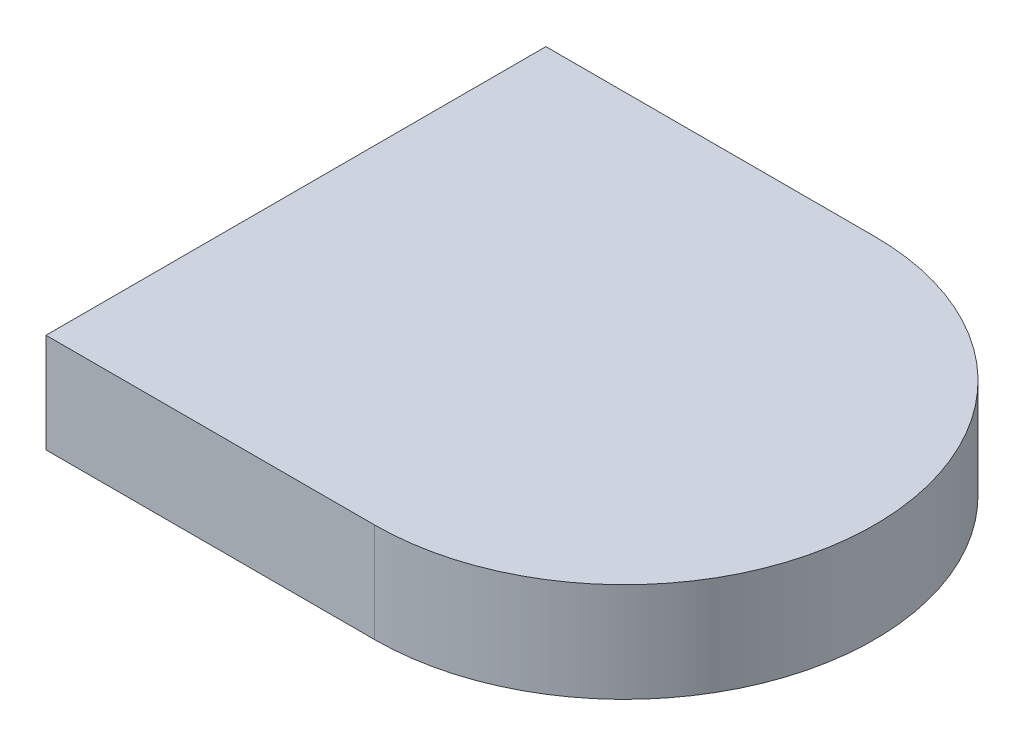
ISO-10303-21;
HEADER;
FILE_DESCRIPTION(('STEP AP214'),'2;1');
FILE_NAME('part.step','',(''),(''),'','','');
FILE_SCHEMA(('AUTOMOTIVE_DESIGN { 1 0 10303 214 1 1 1 1 }'));
ENDSEC;
DATA;
#1=APPLICATION_CONTEXT('core data for automotive mechanical design processes');
#2=APPLICATION_PROTOCOL_DEFINITION('international standard','automotive_design',2000,#1);
#3=PRODUCT_CONTEXT('',#1,'mechanical');
#4=PRODUCT('Part','Part','',(#3));
#5=PRODUCT_RELATED_PRODUCT_CATEGORY('part','',(#4));
#6=PRODUCT_DEFINITION_FORMATION('','',#4);
#7=PRODUCT_DEFINITION_CONTEXT('part definition',#1,'design');
#8=PRODUCT_DEFINITION('design','',#6,#7);
#9=PRODUCT_DEFINITION_SHAPE('','',#8);
#10=(LENGTH_UNIT() NAMED_UNIT(*) SI_UNIT(.MILLI.,.METRE.));
#11=(NAMED_UNIT(*) PLANE_ANGLE_UNIT() SI_UNIT($,.RADIAN.));
#12=(NAMED_UNIT(*) SI_UNIT($,.STERADIAN.) SOLID_ANGLE_UNIT());
#13=UNCERTAINTY_MEASURE_WITH_UNIT(LENGTH_MEASURE(1.E-05),#10,'distance_accuracy_value','');
#14=(GEOMETRIC_REPRESENTATION_CONTEXT(3) GLOBAL_UNCERTAINTY_ASSIGNED_CONTEXT((#13)) GLOBAL_UNIT_ASSIGNED_CONTEXT((#10,
#11,#12)) REPRESENTATION_CONTEXT('',''));
#15=CARTESIAN_POINT('',(0.,0.,0.));
#16=DIRECTION('',(0.,0.,1.));
#17=DIRECTION('',(1.,0.,0.));
#18=AXIS2_PLACEMENT_3D('',#15,#16,#17);
#19=CARTESIAN_POINT('',(0.,30.,0.));
#20=DIRECTION('',(0.,-1.,0.));
#21=DIRECTION('',(0.,0.,-1.));
#22=AXIS2_PLACEMENT_3D('',#19,#20,#21);
#23=CYLINDRICAL_SURFACE('',#22,75.5090673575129);
#24=CARTESIAN_POINT('',(0.,0.,0.));
#25=DIRECTION('',(0.,1.,0.));
#26=DIRECTION('',(0.,0.,-1.));
#27=AXIS2_PLACEMENT_3D('',#24,#25,#26);
#28=CIRCLE('',#27,75.5090673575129);
#29=CARTESIAN_POINT('',(0.,0.,75.5090673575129));
#30=VERTEX_POINT('',#29);
#31=CARTESIAN_POINT('',(0.,0.,-75.5090673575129));
#32=VERTEX_POINT('',#31);
#33=EDGE_CURVE('E99',#30,#32,#28,.T.);
#34=ORIENTED_EDGE('',*,*,#33,.T.);
#35=DIRECTION('',(0.,-1.,0.));
#36=VECTOR('',#35,1.);
#37=CARTESIAN_POINT('',(0.,30.,-75.5090673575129));
#38=LINE('',#37,#36);
#39=CARTESIAN_POINT('',(0.,30.,-75.5090673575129));
#40=VERTEX_POINT('',#39);
#41=EDGE_CURVE('E11',#40,#32,#38,.T.);
#42=ORIENTED_EDGE('',*,*,#41,.F.);
#43=CARTESIAN_POINT('',(0.,30.,0.));
#44=DIRECTION('',(0.,1.,0.));
#45=DIRECTION('',(0.,0.,-1.));
#46=AXIS2_PLACEMENT_3D('',#43,#44,#45);
#47=CIRCLE('',#46,75.5090673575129);
#48=CARTESIAN_POINT('',(0.,30.,75.5090673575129));
#49=VERTEX_POINT('',#48);
#50=EDGE_CURVE('E87',#49,#40,#47,.T.);
#51=ORIENTED_EDGE('',*,*,#50,.F.);
#52=DIRECTION('',(0.,-1.,0.));
#53=VECTOR('',#52,1.);
#54=CARTESIAN_POINT('',(0.,30.,75.5090673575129));
#55=LINE('',#54,#53);
#56=EDGE_CURVE('E95',#49,#30,#55,.T.);
#57=ORIENTED_EDGE('',*,*,#56,.T.);
#58=EDGE_LOOP('',(#34,#42,#51,#57));
#59=FACE_BOUND('',#58,.T.);
#60=ADVANCED_FACE('F36',(#59),#23,.T.);
#61=CARTESIAN_POINT('',(0.,30.,-75.5090673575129));
#62=DIRECTION('',(0.,0.,1.));
#63=DIRECTION('',(1.,0.,0.));
#64=AXIS2_PLACEMENT_3D('',#61,#62,#63);
#65=PLANE('',#64);
#66=DIRECTION('',(-1.,0.,0.));
#67=VECTOR('',#66,1.);
#68=CARTESIAN_POINT('',(0.,0.,-75.5090673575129));
#69=LINE('',#68,#67);
#70=CARTESIAN_POINT('',(-99.2692538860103,0.,-75.5090673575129));
#71=VERTEX_POINT('',#70);
#72=EDGE_CURVE('E91',#32,#71,#69,.T.);
#73=ORIENTED_EDGE('',*,*,#72,.T.);
#74=DIRECTION('',(0.,-1.,0.));
#75=VECTOR('',#74,1.);
#76=CARTESIAN_POINT('',(-99.2692538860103,30.,-75.5090673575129));
#77=LINE('',#76,#75);
#78=CARTESIAN_POINT('',(-99.2692538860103,30.,-75.5090673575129));
#79=VERTEX_POINT('',#78);
#80=EDGE_CURVE('E44',#79,#71,#77,.T.);
#81=ORIENTED_EDGE('',*,*,#80,.F.);
#82=DIRECTION('',(-1.,0.,0.));
#83=VECTOR('',#82,1.);
#84=CARTESIAN_POINT('',(0.,30.,-75.5090673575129));
#85=LINE('',#84,#83);
#86=EDGE_CURVE('E82',#40,#79,#85,.T.);
#87=ORIENTED_EDGE('',*,*,#86,.F.);
#88=ORIENTED_EDGE('',*,*,#41,.T.);
#89=EDGE_LOOP('',(#73,#81,#87,#88));
#90=FACE_BOUND('',#89,.T.);
#91=ADVANCED_FACE('F90',(#90),#65,.F.);
#92=CARTESIAN_POINT('',(-99.2692538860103,30.,-75.5090673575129));
#93=DIRECTION('',(1.,0.,0.));
#94=DIRECTION('',(0.,0.,-1.));
#95=AXIS2_PLACEMENT_3D('',#92,#93,#94);
#96=PLANE('',#95);
#97=DIRECTION('',(0.,0.,1.));
#98=VECTOR('',#97,1.);
#99=CARTESIAN_POINT('',(-99.2692538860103,0.,-75.5090673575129));
#100=LINE('',#99,#98);
#101=CARTESIAN_POINT('',(-99.2692538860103,0.,75.509067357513));
#102=VERTEX_POINT('',#101);
#103=EDGE_CURVE('E69',#71,#102,#100,.T.);
#104=ORIENTED_EDGE('',*,*,#103,.T.);
#105=DIRECTION('',(0.,-1.,0.));
#106=VECTOR('',#105,1.);
#107=CARTESIAN_POINT('',(-99.2692538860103,30.,75.509067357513));
#108=LINE('',#107,#106);
#109=CARTESIAN_POINT('',(-99.2692538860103,30.,75.509067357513));
#110=VERTEX_POINT('',#109);
#111=EDGE_CURVE('E92',#110,#102,#108,.T.);
#112=ORIENTED_EDGE('',*,*,#111,.F.);
#113=DIRECTION('',(0.,0.,1.));
#114=VECTOR('',#113,1.);
#115=CARTESIAN_POINT('',(-99.2692538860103,30.,-75.5090673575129));
#116=LINE('',#115,#114);
#117=EDGE_CURVE('E85',#79,#110,#116,.T.);
#118=ORIENTED_EDGE('',*,*,#117,.F.);
#119=ORIENTED_EDGE('',*,*,#80,.T.);
#120=EDGE_LOOP('',(#104,#112,#118,#119));
#121=FACE_BOUND('',#120,.T.);
#122=ADVANCED_FACE('F93',(#121),#96,.F.);
#123=CARTESIAN_POINT('',(-99.2692538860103,30.,75.509067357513));
#124=DIRECTION('',(0.,0.,-1.));
#125=DIRECTION('',(-1.,0.,0.));
#126=AXIS2_PLACEMENT_3D('',#123,#124,#125);
#127=PLANE('',#126);
#128=DIRECTION('',(1.,0.,0.));
#129=VECTOR('',#128,1.);
#130=CARTESIAN_POINT('',(-99.2692538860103,0.,75.509067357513));
#131=LINE('',#130,#129);
#132=EDGE_CURVE('E75',#102,#30,#131,.T.);
#133=ORIENTED_EDGE('',*,*,#132,.T.);
#134=ORIENTED_EDGE('',*,*,#56,.F.);
#135=DIRECTION('',(1.,0.,0.));
#136=VECTOR('',#135,1.);
#137=CARTESIAN_POINT('',(-99.2692538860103,30.,75.509067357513));
#138=LINE('',#137,#136);
#139=EDGE_CURVE('E52',#110,#49,#138,.T.);
#140=ORIENTED_EDGE('',*,*,#139,.F.);
#141=ORIENTED_EDGE('',*,*,#111,.T.);
#142=EDGE_LOOP('',(#133,#134,#140,#141));
#143=FACE_BOUND('',#142,.T.);
#144=ADVANCED_FACE('F106',(#143),#127,.F.);
#145=CARTESIAN_POINT('',(0.,30.,0.));
#146=DIRECTION('',(0.,-1.,0.));
#147=DIRECTION('',(0.,0.,-1.));
#148=AXIS2_PLACEMENT_3D('',#145,#146,#147);
#149=PLANE('',#148);
#150=ORIENTED_EDGE('',*,*,#50,.T.);
#151=ORIENTED_EDGE('',*,*,#86,.T.);
#152=ORIENTED_EDGE('',*,*,#117,.T.);
#153=ORIENTED_EDGE('',*,*,#139,.T.);
#154=EDGE_LOOP('',(#150,#151,#152,#153));
#155=FACE_BOUND('',#154,.T.);
#156=ADVANCED_FACE('F83',(#155),#149,.F.);
#157=CARTESIAN_POINT('',(0.,0.,0.));
#158=DIRECTION('',(0.,-1.,0.));
#159=DIRECTION('',(0.,0.,-1.));
#160=AXIS2_PLACEMENT_3D('',#157,#158,#159);
#161=PLANE('',#160);
#162=ORIENTED_EDGE('',*,*,#33,.F.);
#163=ORIENTED_EDGE('',*,*,#132,.F.);
#164=ORIENTED_EDGE('',*,*,#103,.F.);
#165=ORIENTED_EDGE('',*,*,#72,.F.);
#166=EDGE_LOOP('',(#162,#163,#164,#165));
#167=FACE_BOUND('',#166,.T.);
#168=ADVANCED_FACE('F109',(#167),#161,.T.);
#169=CLOSED_SHELL('',(#60,#91,#122,#144,#156,#168));
#170=MANIFOLD_SOLID_BREP('B2',#169);
#171=ADVANCED_BREP_SHAPE_REPRESENTATION('',(#18,#170),#14);
#172=SHAPE_DEFINITION_REPRESENTATION(#9,#171);
ENDSEC;
END-ISO-10303-21;
